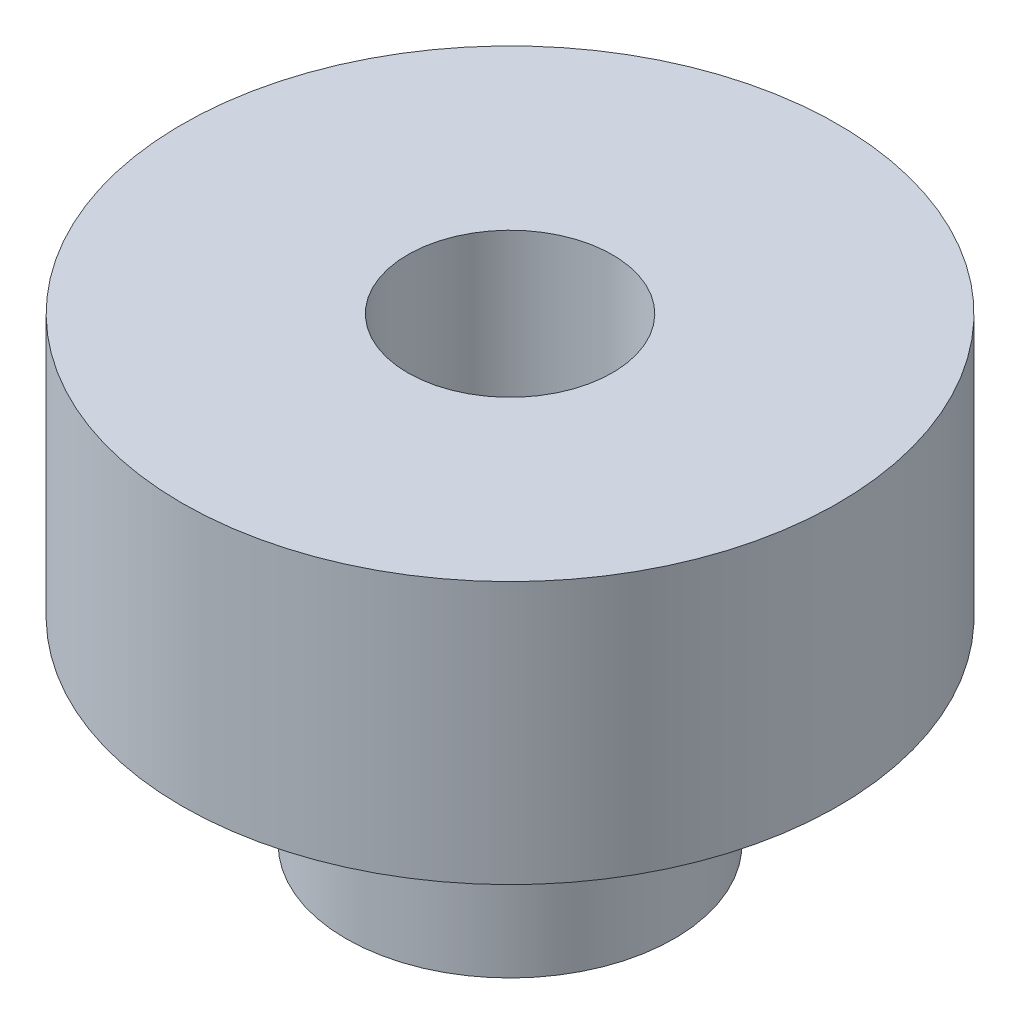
from build123d import *

# Parameters (mm, degrees)
SKETCH2_R          = 1.9812
CUT_EXTRUDE1_DEPTH = 13.636340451


with BuildPart() as part:
    # Sketch1 → Base-Revolve (revolve)
    with BuildSketch(Plane.XY, mode=Mode.PRIVATE) as base_revolve_sk:
        Polygon((0, 0), (6.35, 0), (6.35, -5.08), (3.175, -5.08), (3.175, -8.89), (0, -8.89), align=None)
    revolve(base_revolve_sk.sketch.rotate(Axis((0, 75.599053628, 0), (0, -1, 0)), 90), axis=Axis((0, 75.599053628, 0), (0, -1, 0)))

    # Sketch2 → Cut-Extrude1 (cut, through all)
    with BuildSketch(Plane(origin=(0, 0, 0), x_dir=(-1, 0, 0), z_dir=(0, 1, 0))):
        with Locations(Location((0, 0, 0), (0, 0, 90))):
            Circle(SKETCH2_R)
    extrude(amount=-CUT_EXTRUDE1_DEPTH, mode=Mode.SUBTRACT)


solid = part.part
